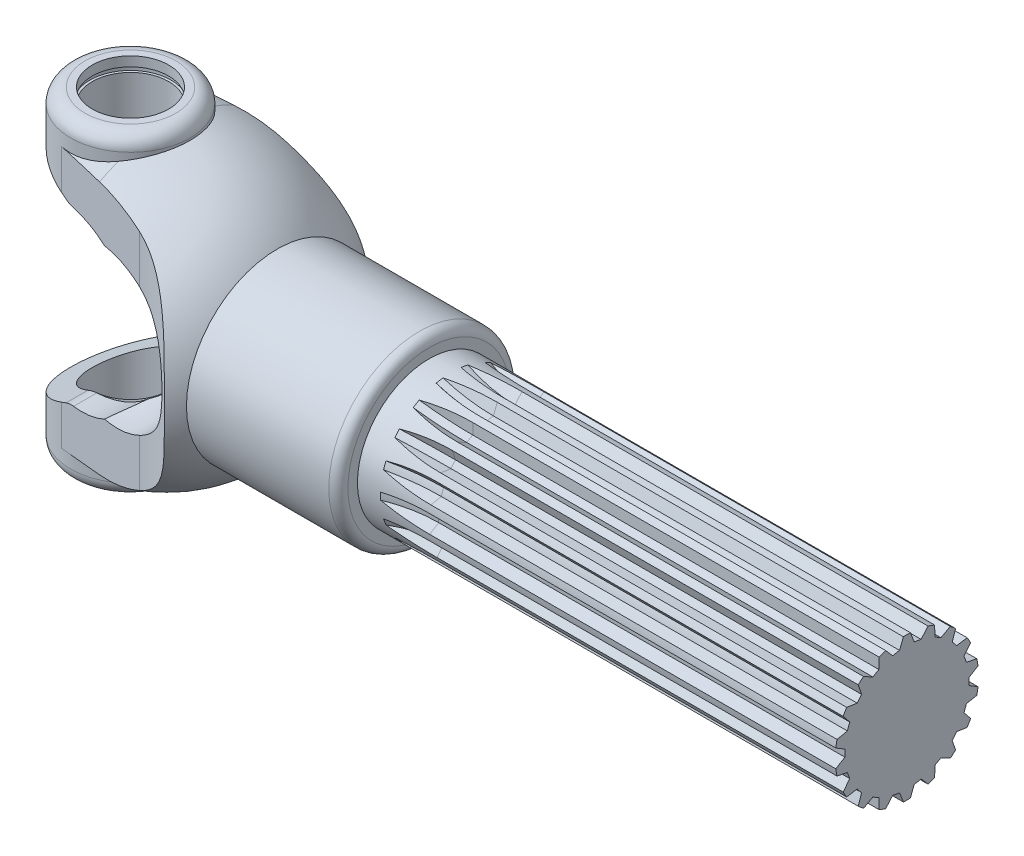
from build123d import *
from build123d.topology import SkipClean

# Parameters (mm, degrees)
CUT_EXTRUDE1_DEPTH      = 168.9471643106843
CUT_EXTRUDE1_DEPTH_BACK = 168.9471643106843
CUT_EXTRUDE2_DEPTH      = 167.6290791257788
CUT_EXTRUDE2_DEPTH_BACK = 167.6290791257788
FILLET1_R               = 5
SKETCH5_R               = 8
CUT_EXTRUDE3_DEPTH      = 177.69535931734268
SKETCH6_W               = 0.5
SKETCH6_H               = 1
FILLET2_R               = 2
CIRPATTERN1_COUNT       = 18


with BuildPart() as part:
    # Sketch1 → Revolve1 (revolve)
    with BuildSketch(Plane.XY, mode=Mode.PRIVATE) as revolve1_sk:
        with BuildLine():
            Line((-12.5, 0), (162.49999999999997, 0))
            Line((162.49999999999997, 0), (162.49999999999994, 15))
            Line((162.49999999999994, 15), (62.49999999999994, 15))
            Line((62.49999999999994, 15), (62.49999999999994, 19))
            Line((62.49999999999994, 19), (30.716373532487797, 19))
            ThreePointArc((30.716373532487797, 19), (20.345232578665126, 27.110883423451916), (7.4999999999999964, 30.000000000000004))
            Line((7.4999999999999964, 30.000000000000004), (-12.500000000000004, 30))
            Line((-12.500000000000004, 30), (-12.5, 0))
        make_face()
    revolve(revolve1_sk.sketch.rotate(Axis((-12.5, 0, 0), (1, 0, 0)), 90), axis=Axis((-12.5, 0, 0), (1, 0, 0)))

    # Sketch2 → Cut-Extrude1 (cut, two sides: drawn at the far end of the back side and taken through both)
    with BuildSketch(Plane(origin=(0, 0, 0), x_dir=(1, 0, 0), z_dir=(0, 1, 0)).offset(-CUT_EXTRUDE1_DEPTH_BACK)):
        with BuildLine():
            Line((28.500000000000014, -21.424285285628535), (28.500000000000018, -41.42428528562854))
            Line((28.500000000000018, -41.42428528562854), (-41.499999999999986, -41.42428528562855))
            Line((-41.499999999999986, -41.42428528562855), (-41.499999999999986, 41.42428528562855))
            Line((-41.499999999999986, 41.42428528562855), (28.500000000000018, 41.42428528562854))
            Line((28.500000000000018, 41.42428528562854), (28.500000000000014, 21.424285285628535))
            ThreePointArc((28.500000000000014, 21.424285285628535), (23.504274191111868, 17.71131837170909), (17.60901080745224, 15.714002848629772))
            Line((17.60901080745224, 15.714002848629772), (-2.1199172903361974, 12.31892652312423))
            ThreePointArc((-2.1199172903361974, 12.31892652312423), (-12.5, 1.53e-15), (-2.1199172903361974, -12.31892652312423))
            Line((-2.1199172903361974, -12.31892652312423), (17.60901080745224, -15.714002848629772))
            ThreePointArc((17.60901080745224, -15.714002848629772), (23.504274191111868, -17.71131837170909), (28.500000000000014, -21.424285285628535))
        make_face()
    extrude(amount=CUT_EXTRUDE1_DEPTH + CUT_EXTRUDE1_DEPTH_BACK, mode=Mode.SUBTRACT)

    # Sketch3 → Cut-Extrude2 (cut, two sides: drawn at the far end of the back side and taken through both)
    with BuildSketch(Plane.XY.offset(-CUT_EXTRUDE2_DEPTH_BACK)):
        Polygon((-12.499999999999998, 24), (3.9e-15, 18), (8.24e-15, -18.000000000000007), (-12.499999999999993, -24.000000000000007), align=None)
    extrude(amount=CUT_EXTRUDE2_DEPTH + CUT_EXTRUDE2_DEPTH_BACK, mode=Mode.SUBTRACT)

    # Sketch7 → Cut-Revolve2 (revolve, cut)
    with BuildSketch(Plane(origin=(0, 0, 0), x_dir=(0, 0, -1), z_dir=(1, 1.2e-16, 0))):
        with BuildLine():
            Line((-20.000000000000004, 18.000000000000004), (-8, 18.000000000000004))
            ThreePointArc((-8, 18.000000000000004), (1.21e-15, 19.69771560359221), (8, 18.000000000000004))
            Line((8, 18.000000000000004), (20.000000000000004, 18.000000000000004))
            Line((20.000000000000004, 18.000000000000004), (20, -3.47e-15))
            Line((20, -3.47e-15), (-20, -3.47e-15))
            Line((-20, -3.47e-15), (-20.000000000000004, 18.000000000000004))
        make_face()
    revolve(axis=Axis((0, -3.47e-15, 20), (0, 0, -1)), mode=Mode.SUBTRACT)

    # Fillet1
    fillet1_edges = [part.edges().sort_by_distance(p)[0] for p in [
        (8.24e-15, -18.000000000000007, -10.341867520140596),
        (8.24e-15, -18.000000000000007, 10.341867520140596),
        (3.9e-15, 18, -10.341867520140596),
        (3.9e-15, 18, 10.341867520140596),
    ]]
    fillet(fillet1_edges, radius=FILLET1_R)

    # Sketch4 → Revolve2 (revolve)
    with SkipClean():  # the faces are left unmerged after this step: merging them gives an invalid solid
        with BuildSketch(Plane.XY, mode=Mode.PRIVATE) as revolve2_sk:
            with BuildLine():
                Line((-9.500000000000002, 33), (-4e-17, 33))
                Line((-4e-17, 33), (1.1e-15, 23.99999999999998))
                Line((1.1e-15, 23.99999999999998), (-12.499999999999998, 23.999999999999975))
                Line((-12.499999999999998, 23.999999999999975), (-12.500000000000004, 30))
                ThreePointArc((-12.500000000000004, 30), (-11.621320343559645, 32.121320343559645), (-9.500000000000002, 33))
            make_face()
        revolve2 = revolve(revolve2_sk.sketch.rotate(Axis((-4e-17, 33, 0), (1.3e-16, -1, 0)), 279.764178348), axis=Axis((-4e-17, 33, 0), (1.3e-16, -1, 0)))

    # Mirror1: Revolve2 across plane
    add(revolve2.mirror(Plane.ZX))

    # Sketch5 → Cut-Extrude3 (cut, through all)
    with BuildSketch(Plane(origin=(-4.2e-15, 33, 0), x_dir=(1, 1.3e-16, 0), z_dir=(-1.3e-16, 1, 0))):
        with Locations(Location((0, 0, 0), (0, 0, 180))):
            Circle(SKETCH5_R)
    extrude(amount=-CUT_EXTRUDE3_DEPTH, mode=Mode.SUBTRACT)

    # Sketch6 → Cut-Revolve1 (revolve, cut)
    with BuildSketch(Plane.XY, mode=Mode.PRIVATE) as cut_revolve1_sk:
        with Locations((8.25, 30.500000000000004)):
            Rectangle(SKETCH6_W, SKETCH6_H)
        with Locations((8.25, -30.500000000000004)):
            Rectangle(SKETCH6_W, SKETCH6_H)
    revolve(cut_revolve1_sk.sketch.rotate(Axis((0, 0, 0), (0, 1, 0)), 180), axis=Axis((0, 0, 0), (0, 1, 0)), mode=Mode.SUBTRACT)

    # Sketch8 → Cut-Revolve3 (revolve, cut)
    with BuildSketch(Plane(origin=(0, 0, 0), x_dir=(1, 0, 0), z_dir=(0, 1, 0))):
        with BuildLine():
            Line((19.37395372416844, 3.5566721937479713), (6.383572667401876, 11.056672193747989))
            Line((6.383572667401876, 11.056672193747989), (14.563591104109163, 25.224879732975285))
            Line((14.563591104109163, 25.224879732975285), (25.500000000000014, 18.910741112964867))
            ThreePointArc((25.500000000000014, 18.910741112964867), (24.097569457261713, 10.571154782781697), (19.37395372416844, 3.5566721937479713))
        make_face()
    cut_revolve3 = revolve(axis=Axis((-11.032946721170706, 0, 19.109624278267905), (0.500000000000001, 0, -0.8660254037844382)), mode=Mode.SUBTRACT)

    # Mirror2: Cut-Revolve3 across plane
    add(cut_revolve3.mirror(Plane.XY), mode=Mode.SUBTRACT)

    # Fillet2
    fillet2_edges = [part.edges().sort_by_distance(p)[0] for p in [
        (62.49999999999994, -4.44e-15, -19),
    ]]
    fillet(fillet2_edges, radius=FILLET2_R)

    # Cut-Sweep1: sweep along a path in Sketch10
    with SkipClean():  # the faces are left unmerged after this step: merging them gives an invalid solid
        with BuildLine(Plane(origin=(0, 0, 0), x_dir=(1, 0, 0), z_dir=(0, 0.17364817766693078, 0.9848077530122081))) as cut_sweep1_path:
            Line((162.49999999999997, 15), (77.49999999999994, 14.99999999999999))
            ThreePointArc((77.49999999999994, 14.99999999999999), (71.8541434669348, 15.645856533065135), (66.49999999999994, 17.550055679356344))
        # Sketch9 → Cut-Sweep1 (sweep, cut)
        with BuildSketch(Plane(origin=(162.49999999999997, 0, 0), x_dir=(0, 0, -1), z_dir=(1, 0, 0))):
            with BuildLine():
                Line((0.7327465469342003, 14.982092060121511), (1.539251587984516, 12.908551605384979))
                ThreePointArc((1.539251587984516, 12.908551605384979), (2.257426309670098, 12.802500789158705), (2.968561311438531, 12.656525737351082))
                Line((2.968561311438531, 12.656525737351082), (4.435620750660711, 14.329175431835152))
                ThreePointArc((4.435620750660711, 14.329175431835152), (2.6047226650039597, 14.772116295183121), (0.7327465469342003, 14.982092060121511))
            make_face()
        cut_sweep1 = sweep(path=cut_sweep1_path.line, mode=Mode.SUBTRACT)

    # CirPattern1: Cut-Sweep1 ×18 about axis
    with SkipClean():  # the faces are left unmerged after this step: merging them gives an invalid solid
        cirpattern1_axis = Axis((0, -1.4e-16, 8e-17), (1, 0, 0))
        for i in range(1, CIRPATTERN1_COUNT):
            add(cut_sweep1.rotate(cirpattern1_axis, i * 360 / CIRPATTERN1_COUNT), mode=Mode.SUBTRACT)


solid = part.part
